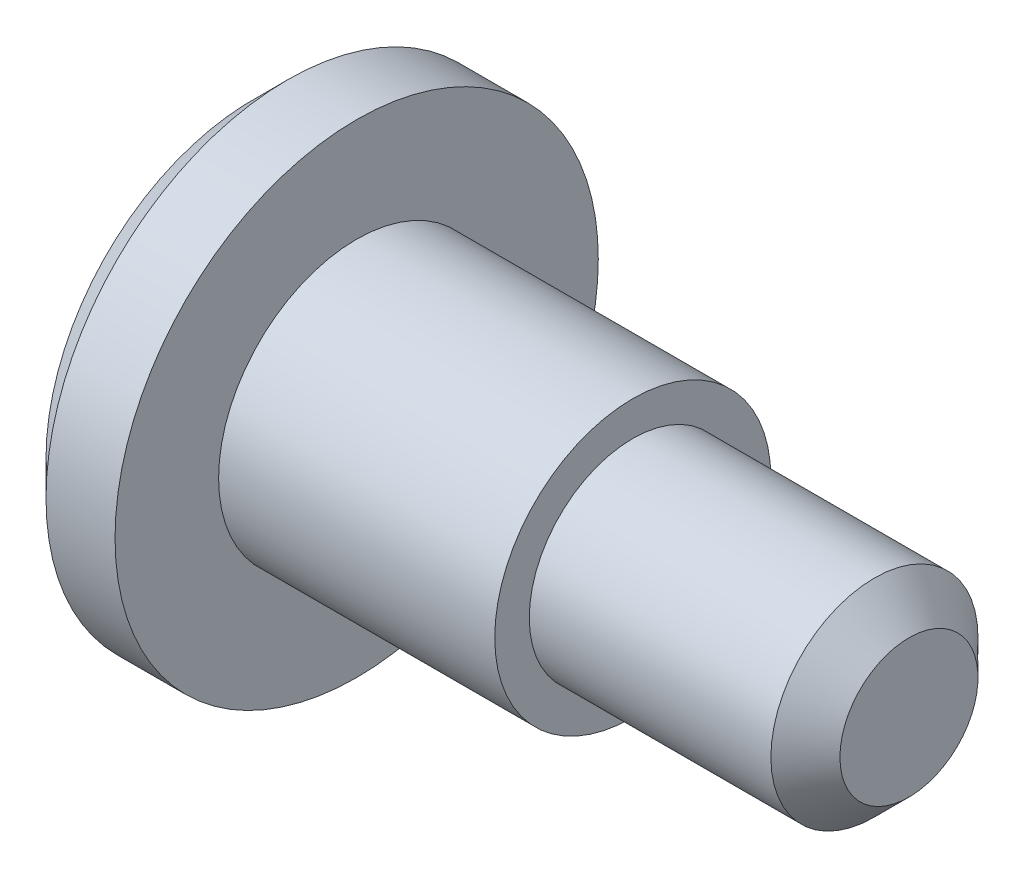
from build123d import *

# Parameters (mm, degrees)
ZKOSEN_1_SIZE = 0.5


with BuildPart() as part:
    # Skica1 → Rotovat1 (revolve)
    with BuildSketch(Plane.XY, mode=Mode.PRIVATE) as rotovat1_sk:
        Polygon((-1.5, 0), (-1.5, 3.5), (0, 3.5), (0, 2), (4, 2), (4, 1.5), (8, 1.5), (8, 0), align=None)
    revolve(rotovat1_sk.sketch.rotate(Axis((-3.000952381, 0, 0), (1, 0, 0)), 90), axis=Axis((-3.000952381, 0, 0), (1, 0, 0)))

    # Zkosen_1
    zkosen_1_edges = [part.edges().sort_by_distance(p)[0] for p in [
        (8, 0, -1.5),
        (-1.5, 0, -3.5),
    ]]
    chamfer(zkosen_1_edges, length=ZKOSEN_1_SIZE)


solid = part.part
